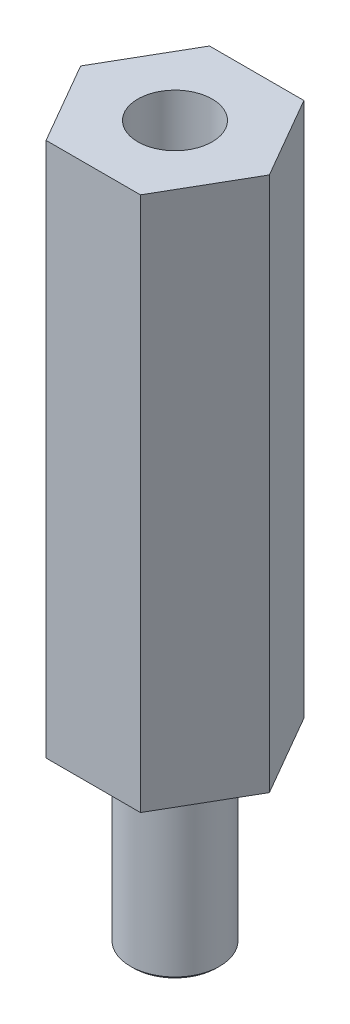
from build123d import *

# Parameters (mm, degrees)
SKETCH_1_R      = 1.25
EXTRUDE_1_DEPTH = 18
SKETCH_2_R      = 1.5
EXTRUDE_2_DEPTH = 6
CHAMFER_1_SIZE  = 0.1


with BuildPart() as part:
    # Sketch 1 → Extrude 1 (new body)
    with BuildSketch(Plane(origin=(0, 0, 0), x_dir=(1, 0, 0), z_dir=(0, 1, 0))):
        Polygon((3.175426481, 0), (1.58771324, 2.75), (-1.58771324, 2.75), (-3.175426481, 0), (-1.58771324, -2.75), (1.58771324, -2.75), align=None)
        with Locations(Location((0, 0, 0), (0, 0, 270))):
            Circle(SKETCH_1_R, mode=Mode.SUBTRACT)
    extrude(amount=EXTRUDE_1_DEPTH)

    # Sketch 2 → Extrude 2 (add)
    with BuildSketch(Plane.XZ):
        with Locations(Location((0, 0, 0), (0, 0, 90))):
            Circle(SKETCH_2_R)
    extrude(amount=EXTRUDE_2_DEPTH)

    # Chamfer 1
    chamfer_1_edges = [part.edges().sort_by_distance(p)[0] for p in [
        (0, -6, -1.5),
    ]]
    chamfer(chamfer_1_edges, length=CHAMFER_1_SIZE)


solid = part.part
